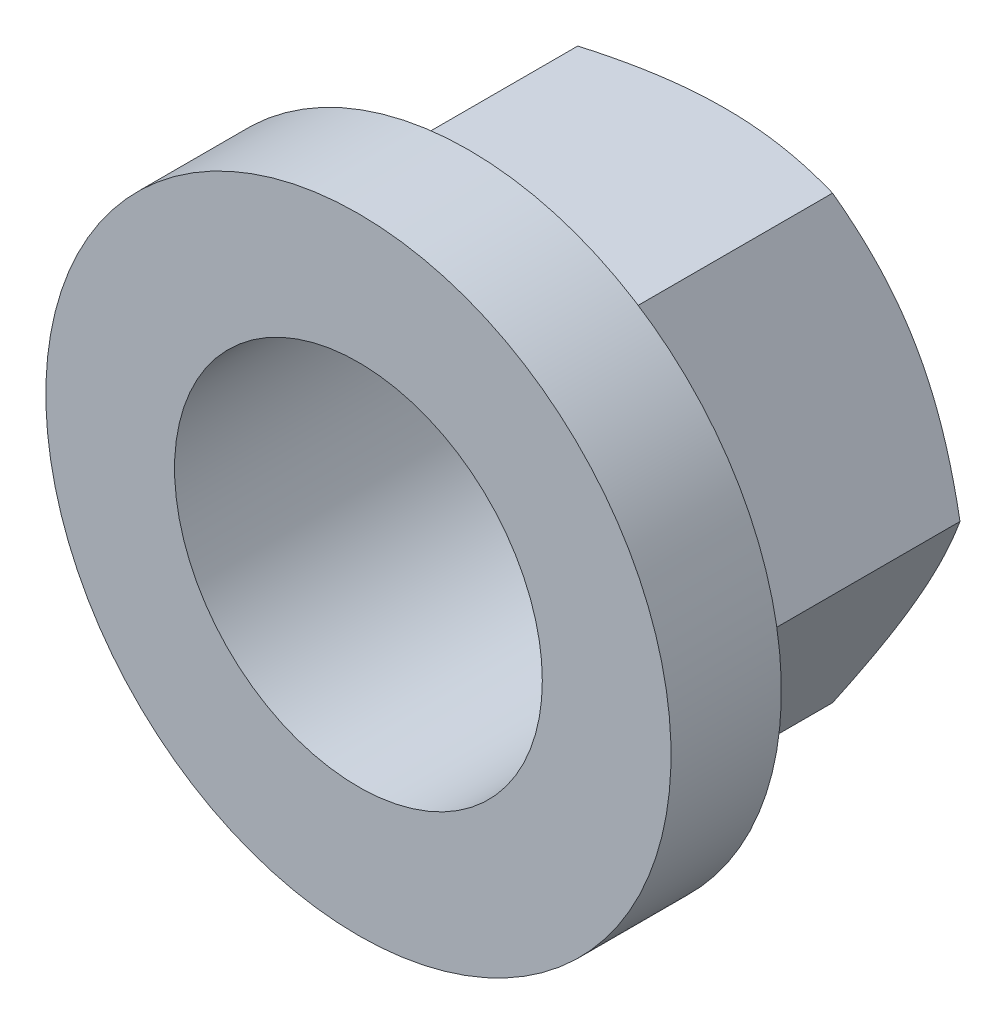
ISO-10303-21;
HEADER;
FILE_DESCRIPTION(('STEP AP214'),'2;1');
FILE_NAME('part.step','',(''),(''),'','','');
FILE_SCHEMA(('AUTOMOTIVE_DESIGN { 1 0 10303 214 1 1 1 1 }'));
ENDSEC;
DATA;
#1=APPLICATION_CONTEXT('core data for automotive mechanical design processes');
#2=APPLICATION_PROTOCOL_DEFINITION('international standard','automotive_design',2000,#1);
#3=PRODUCT_CONTEXT('',#1,'mechanical');
#4=PRODUCT('Part','Part','',(#3));
#5=PRODUCT_RELATED_PRODUCT_CATEGORY('part','',(#4));
#6=PRODUCT_DEFINITION_FORMATION('','',#4);
#7=PRODUCT_DEFINITION_CONTEXT('part definition',#1,'design');
#8=PRODUCT_DEFINITION('design','',#6,#7);
#9=PRODUCT_DEFINITION_SHAPE('','',#8);
#10=(LENGTH_UNIT() NAMED_UNIT(*) SI_UNIT(.MILLI.,.METRE.));
#11=(NAMED_UNIT(*) PLANE_ANGLE_UNIT() SI_UNIT($,.RADIAN.));
#12=(NAMED_UNIT(*) SI_UNIT($,.STERADIAN.) SOLID_ANGLE_UNIT());
#13=UNCERTAINTY_MEASURE_WITH_UNIT(LENGTH_MEASURE(1.E-05),#10,'distance_accuracy_value','');
#14=(GEOMETRIC_REPRESENTATION_CONTEXT(3) GLOBAL_UNCERTAINTY_ASSIGNED_CONTEXT((#13)) GLOBAL_UNIT_ASSIGNED_CONTEXT((#10,
#11,#12)) REPRESENTATION_CONTEXT('',''));
#15=CARTESIAN_POINT('',(0.,0.,0.));
#16=DIRECTION('',(0.,0.,1.));
#17=DIRECTION('',(1.,0.,0.));
#18=AXIS2_PLACEMENT_3D('',#15,#16,#17);
#19=CARTESIAN_POINT('',(0.,0.,3.21410161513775));
#20=DIRECTION('',(0.,0.,-1.));
#21=DIRECTION('',(0.,1.,0.));
#22=AXIS2_PLACEMENT_3D('',#19,#20,#21);
#23=PLANE('',#22);
#24=CARTESIAN_POINT('',(0.,0.,3.21410161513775));
#25=DIRECTION('',(0.,0.,-1.));
#26=DIRECTION('',(0.,1.,0.));
#27=AXIS2_PLACEMENT_3D('',#24,#25,#26);
#28=CIRCLE('',#27,8.5);
#29=CARTESIAN_POINT('',(0.,8.5,3.21410161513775));
#30=VERTEX_POINT('',#29);
#31=EDGE_CURVE('E252',#30,#30,#28,.T.);
#32=ORIENTED_EDGE('',*,*,#31,.T.);
#33=EDGE_LOOP('',(#32));
#34=FACE_BOUND('',#33,.T.);
#35=DIRECTION('',(-1.,0.,0.));
#36=VECTOR('',#35,1.);
#37=CARTESIAN_POINT('',(-3.46410161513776,-6.,3.21410161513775));
#38=LINE('',#37,#36);
#39=CARTESIAN_POINT('',(3.46410161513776,-6.,3.21410161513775));
#40=VERTEX_POINT('',#39);
#41=CARTESIAN_POINT('',(-3.46410161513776,-6.,3.21410161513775));
#42=VERTEX_POINT('',#41);
#43=EDGE_CURVE('E226',#40,#42,#38,.T.);
#44=ORIENTED_EDGE('',*,*,#43,.F.);
#45=DIRECTION('',(-0.5,-0.866025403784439,0.));
#46=VECTOR('',#45,1.);
#47=CARTESIAN_POINT('',(3.46410161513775,-6.,3.21410161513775));
#48=LINE('',#47,#46);
#49=CARTESIAN_POINT('',(6.92820323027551,0.,3.21410161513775));
#50=VERTEX_POINT('',#49);
#51=EDGE_CURVE('E263',#50,#40,#48,.T.);
#52=ORIENTED_EDGE('',*,*,#51,.F.);
#53=DIRECTION('',(0.5,-0.866025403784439,0.));
#54=VECTOR('',#53,1.);
#55=CARTESIAN_POINT('',(6.92820323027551,0.,3.21410161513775));
#56=LINE('',#55,#54);
#57=CARTESIAN_POINT('',(3.46410161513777,6.,3.21410161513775));
#58=VERTEX_POINT('',#57);
#59=EDGE_CURVE('E114',#58,#50,#56,.T.);
#60=ORIENTED_EDGE('',*,*,#59,.F.);
#61=DIRECTION('',(1.,0.,0.));
#62=VECTOR('',#61,1.);
#63=CARTESIAN_POINT('',(3.46410161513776,6.,3.21410161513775));
#64=LINE('',#63,#62);
#65=CARTESIAN_POINT('',(-3.46410161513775,6.00000000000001,3.21410161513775));
#66=VERTEX_POINT('',#65);
#67=EDGE_CURVE('E109',#66,#58,#64,.T.);
#68=ORIENTED_EDGE('',*,*,#67,.F.);
#69=DIRECTION('',(0.5,0.866025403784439,0.));
#70=VECTOR('',#69,1.);
#71=CARTESIAN_POINT('',(-3.46410161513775,6.,3.21410161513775));
#72=LINE('',#71,#70);
#73=CARTESIAN_POINT('',(-6.9282032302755,0.,3.21410161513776));
#74=VERTEX_POINT('',#73);
#75=EDGE_CURVE('E111',#74,#66,#72,.T.);
#76=ORIENTED_EDGE('',*,*,#75,.F.);
#77=DIRECTION('',(-0.499999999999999,0.866025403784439,0.));
#78=VECTOR('',#77,1.);
#79=CARTESIAN_POINT('',(-6.9282032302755,0.,3.21410161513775));
#80=LINE('',#79,#78);
#81=EDGE_CURVE('E126',#42,#74,#80,.T.);
#82=ORIENTED_EDGE('',*,*,#81,.F.);
#83=EDGE_LOOP('',(#44,#52,#60,#68,#76,#82));
#84=FACE_BOUND('',#83,.T.);
#85=ADVANCED_FACE('F34',(#34,#84),#23,.T.);
#86=CARTESIAN_POINT('',(0.,0.,0.));
#87=DIRECTION('',(0.,0.,-1.));
#88=DIRECTION('',(0.,1.,0.));
#89=AXIS2_PLACEMENT_3D('',#86,#87,#88);
#90=CYLINDRICAL_SURFACE('',#89,8.5);
#91=CARTESIAN_POINT('',(0.,0.,6.21410161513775));
#92=DIRECTION('',(0.,0.,-1.));
#93=DIRECTION('',(0.,1.,0.));
#94=AXIS2_PLACEMENT_3D('',#91,#92,#93);
#95=CIRCLE('',#94,8.5);
#96=CARTESIAN_POINT('',(0.,8.5,6.21410161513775));
#97=VERTEX_POINT('',#96);
#98=EDGE_CURVE('E254',#97,#97,#95,.T.);
#99=ORIENTED_EDGE('',*,*,#98,.T.);
#100=EDGE_LOOP('',(#99));
#101=FACE_BOUND('',#100,.T.);
#102=ORIENTED_EDGE('',*,*,#31,.F.);
#103=EDGE_LOOP('',(#102));
#104=FACE_BOUND('',#103,.T.);
#105=ADVANCED_FACE('F243',(#101,#104),#90,.T.);
#106=CARTESIAN_POINT('',(0.,0.,6.21410161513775));
#107=DIRECTION('',(0.,0.,1.));
#108=DIRECTION('',(0.,-1.,0.));
#109=AXIS2_PLACEMENT_3D('',#106,#107,#108);
#110=PLANE('',#109);
#111=CARTESIAN_POINT('',(0.,0.,6.21410161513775));
#112=DIRECTION('',(0.,0.,1.));
#113=DIRECTION('',(1.,0.,0.));
#114=AXIS2_PLACEMENT_3D('',#111,#112,#113);
#115=CIRCLE('',#114,5.);
#116=CARTESIAN_POINT('',(5.,0.,6.21410161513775));
#117=VERTEX_POINT('',#116);
#118=EDGE_CURVE('E287',#117,#117,#115,.T.);
#119=ORIENTED_EDGE('',*,*,#118,.F.);
#120=EDGE_LOOP('',(#119));
#121=FACE_BOUND('',#120,.T.);
#122=ORIENTED_EDGE('',*,*,#98,.F.);
#123=EDGE_LOOP('',(#122));
#124=FACE_BOUND('',#123,.T.);
#125=ADVANCED_FACE('F248',(#121,#124),#110,.T.);
#126=CARTESIAN_POINT('',(-3.46410161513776,-6.,3.75));
#127=DIRECTION('',(0.,1.,0.));
#128=DIRECTION('',(-1.,0.,0.));
#129=AXIS2_PLACEMENT_3D('',#126,#127,#128);
#130=PLANE('',#129);
#131=DIRECTION('',(0.,0.,-1.));
#132=VECTOR('',#131,1.);
#133=CARTESIAN_POINT('',(3.46410161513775,-6.,3.75));
#134=LINE('',#133,#132);
#135=CARTESIAN_POINT('',(3.46410161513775,-6.,-3.21410161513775));
#136=VERTEX_POINT('',#135);
#137=EDGE_CURVE('E140',#40,#136,#134,.T.);
#138=ORIENTED_EDGE('',*,*,#137,.F.);
#139=ORIENTED_EDGE('',*,*,#43,.T.);
#140=DIRECTION('',(0.,0.,-1.));
#141=VECTOR('',#140,1.);
#142=CARTESIAN_POINT('',(-3.46410161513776,-6.,3.75));
#143=LINE('',#142,#141);
#144=CARTESIAN_POINT('',(-3.46410161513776,-6.,-3.21410161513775));
#145=VERTEX_POINT('',#144);
#146=EDGE_CURVE('E136',#42,#145,#143,.T.);
#147=ORIENTED_EDGE('',*,*,#146,.T.);
#148=CARTESIAN_POINT('',(-9.37434719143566,-6.,-0.788154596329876));
#149=CARTESIAN_POINT('',(-9.11159664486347,-6.,-0.915889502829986));
#150=CARTESIAN_POINT('',(-8.84825012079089,-6.,-1.04241913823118));
#151=CARTESIAN_POINT('',(-8.32004824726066,-6.,-1.29239100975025));
#152=CARTESIAN_POINT('',(-8.05519267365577,-6.,-1.41583277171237));
#153=CARTESIAN_POINT('',(-7.52232548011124,-6.,-1.6595577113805));
#154=CARTESIAN_POINT('',(-7.25430457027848,-6.,-1.77982064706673));
#155=CARTESIAN_POINT('',(-6.71615392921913,-6.,-2.0155135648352));
#156=CARTESIAN_POINT('',(-6.44602429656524,-6.,-2.13094377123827));
#157=CARTESIAN_POINT('',(-5.89445558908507,-6.,-2.35932867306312));
#158=CARTESIAN_POINT('',(-5.61293307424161,-6.,-2.47208293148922));
#159=CARTESIAN_POINT('',(-5.04662051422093,-6.,-2.68922432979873));
#160=CARTESIAN_POINT('',(-4.7618301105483,-6.,-2.7936105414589));
#161=CARTESIAN_POINT('',(-4.18903963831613,-6.,-2.99132808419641));
#162=CARTESIAN_POINT('',(-3.90104714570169,-6.,-3.08468115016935));
#163=CARTESIAN_POINT('',(-3.32092961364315,-6.,-3.25738274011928));
#164=CARTESIAN_POINT('',(-3.02880588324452,-6.,-3.33673559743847));
#165=CARTESIAN_POINT('',(-2.44180312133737,-6.,-3.47727999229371));
#166=CARTESIAN_POINT('',(-2.14694713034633,-6.,-3.5385662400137));
#167=CARTESIAN_POINT('',(-1.55345729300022,-6.,-3.63951072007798));
#168=CARTESIAN_POINT('',(-1.25482386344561,-6.,-3.67917131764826));
#169=CARTESIAN_POINT('',(-0.807215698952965,-6.,-3.71981310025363));
#170=CARTESIAN_POINT('',(-0.659059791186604,-6.,-3.73021070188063));
#171=CARTESIAN_POINT('',(-0.362434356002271,-6.,-3.74473309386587));
#172=CARTESIAN_POINT('',(-0.213964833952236,-6.,-3.74885799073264));
#173=CARTESIAN_POINT('',(0.0830171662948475,-6.,-3.75072952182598));
#174=CARTESIAN_POINT('',(0.23152964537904,-6.,-3.74847601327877));
#175=CARTESIAN_POINT('',(0.528326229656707,-6.,-3.73764825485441));
#176=CARTESIAN_POINT('',(0.676610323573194,-6.,-3.72907370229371));
#177=CARTESIAN_POINT('',(1.0307338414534,-6.,-3.7012311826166));
#178=CARTESIAN_POINT('',(1.23635220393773,-6.,-3.67908921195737));
#179=CARTESIAN_POINT('',(1.64609980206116,-6.,-3.62384140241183));
#180=CARTESIAN_POINT('',(1.85022884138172,-6.,-3.59073414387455));
#181=CARTESIAN_POINT('',(2.46011094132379,-6.,-3.47671763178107));
#182=CARTESIAN_POINT('',(2.8631585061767,-6.,-3.38113151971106));
#183=CARTESIAN_POINT('',(3.46624827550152,-6.,-3.21482537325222));
#184=CARTESIAN_POINT('',(3.66939855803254,-6.,-3.15472502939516));
#185=CARTESIAN_POINT('',(4.07372546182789,-6.,-3.02815690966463));
#186=CARTESIAN_POINT('',(4.27490206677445,-6.,-2.96168908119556));
#187=CARTESIAN_POINT('',(4.67534909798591,-6.,-2.82346306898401));
#188=CARTESIAN_POINT('',(4.87462004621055,-6.,-2.75170638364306));
#189=CARTESIAN_POINT('',(5.27149669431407,-6.,-2.60375957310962));
#190=CARTESIAN_POINT('',(5.4691024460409,-6.,-2.5275695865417));
#191=CARTESIAN_POINT('',(6.05329419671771,-6.,-2.29601415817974));
#192=CARTESIAN_POINT('',(6.43778007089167,-6.,-2.13535342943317));
#193=CARTESIAN_POINT('',(7.20237916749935,-6.,-1.80390412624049));
#194=CARTESIAN_POINT('',(7.58249171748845,-6.00000000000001,-1.633114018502));
#195=CARTESIAN_POINT('',(8.33949830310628,-6.00000000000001,-1.28408337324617));
#196=CARTESIAN_POINT('',(8.71639063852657,-6.00000000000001,-1.10583916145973));
#197=CARTESIAN_POINT('',(9.46750615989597,-6.00000000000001,-0.743889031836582));
#198=CARTESIAN_POINT('',(9.84172949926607,-6.00000000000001,-0.560183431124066));
#199=CARTESIAN_POINT('',(10.5888150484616,-6.00000000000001,-0.188264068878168));
#200=CARTESIAN_POINT('',(10.9616733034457,-6.00000000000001,-4.23807468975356E-05));
#201=CARTESIAN_POINT('',(11.7057456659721,-6.00000000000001,0.379628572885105));
#202=CARTESIAN_POINT('',(12.0769597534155,-6.00000000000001,0.571077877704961));
#203=CARTESIAN_POINT('',(12.8179592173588,-6.00000000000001,0.956459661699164));
#204=CARTESIAN_POINT('',(13.1877449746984,-6.00000000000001,1.15039140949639));
#205=CARTESIAN_POINT('',(13.9262438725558,-6.00000000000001,1.54028763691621));
#206=CARTESIAN_POINT('',(14.2949570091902,-6.00000000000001,1.73625212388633));
#207=CARTESIAN_POINT('',(15.3097665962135,-6.00000000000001,2.2785046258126));
#208=CARTESIAN_POINT('',(15.9549512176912,-6.00000000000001,2.62649859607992));
#209=CARTESIAN_POINT('',(17.2434201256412,-6.00000000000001,3.32610499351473));
#210=CARTESIAN_POINT('',(17.8867042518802,-6.00000000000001,3.67771771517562));
#211=CARTESIAN_POINT('',(19.1694209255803,-6.00000000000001,4.38227161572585));
#212=CARTESIAN_POINT('',(19.8088588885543,-6.00000000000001,4.73520294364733));
#213=CARTESIAN_POINT('',(21.0865502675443,-6.00000000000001,5.44305970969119));
#214=CARTESIAN_POINT('',(21.7248037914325,-6.00000000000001,5.79798495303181));
#215=CARTESIAN_POINT('',(22.3626558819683,-6.00000000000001,6.15362541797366));
#216=B_SPLINE_CURVE_WITH_KNOTS('',3,(#148,#149,#150,#151,#152,#153,#154,#155,#156,#157,#158,
#159,#160,#161,#162,#163,#164,#165,#166,#167,#168,#169,#170,#171,#172,#173,#174,#175,#176,#177,
#178,#179,#180,#181,#182,#183,#184,#185,#186,#187,#188,#189,#190,#191,#192,#193,#194,#195,#196,
#197,#198,#199,#200,#201,#202,#203,#204,#205,#206,#207,#208,#209,#210,#211,#212,#213,#214,#215),
.UNSPECIFIED.,.F.,.F.,(4,2,2,2,2,2,2,2,2,2,2,2,2,2,2,2,2,2,2,2,2,2,2,2,2,2,2,2,2,2,2,2,2,4),(0.,
0.876472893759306,1.75307955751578,2.63433891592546,3.51555732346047,4.42524359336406,
5.33503063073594,6.24299444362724,7.15067672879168,8.05351243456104,8.95624937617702,
9.4016977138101,9.84713848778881,10.292589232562,10.7380613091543,11.3581343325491,
11.9782876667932,13.2191954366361,13.8547020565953,14.4902139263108,15.1255464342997,
15.7608590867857,17.0107329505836,18.260796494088,19.5114836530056,20.7620983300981,
22.0150971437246,23.2681112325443,24.5207642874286,25.7734218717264,27.9725551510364,
30.1718688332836,32.3629769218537,34.5538745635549),.UNSPECIFIED.);
#217=CARTESIAN_POINT('',(0.,-6.,-3.75));
#218=VERTEX_POINT('',#217);
#219=EDGE_CURVE('E211',#218,#145,#216,.F.);
#220=ORIENTED_EDGE('',*,*,#219,.F.);
#221=EDGE_CURVE('E216',#136,#218,#216,.F.);
#222=ORIENTED_EDGE('',*,*,#221,.F.);
#223=EDGE_LOOP('',(#138,#139,#147,#220,#222));
#224=FACE_BOUND('',#223,.T.);
#225=ADVANCED_FACE('F36',(#224),#130,.F.);
#226=CARTESIAN_POINT('',(3.46410161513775,-6.,3.75));
#227=DIRECTION('',(-0.866025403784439,0.5,0.));
#228=DIRECTION('',(-0.5,-0.866025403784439,0.));
#229=AXIS2_PLACEMENT_3D('',#226,#227,#228);
#230=PLANE('',#229);
#231=DIRECTION('',(0.,0.,-1.));
#232=VECTOR('',#231,1.);
#233=CARTESIAN_POINT('',(6.92820323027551,0.,3.75));
#234=LINE('',#233,#232);
#235=CARTESIAN_POINT('',(6.92820323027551,0.,-3.21410161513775));
#236=VERTEX_POINT('',#235);
#237=EDGE_CURVE('E134',#50,#236,#234,.T.);
#238=ORIENTED_EDGE('',*,*,#237,.F.);
#239=ORIENTED_EDGE('',*,*,#51,.T.);
#240=ORIENTED_EDGE('',*,*,#137,.T.);
#241=CARTESIAN_POINT('',(6.92831870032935,0.0002,-3.21403494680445));
#242=CARTESIAN_POINT('',(6.85217369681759,-0.131687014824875,-3.25799100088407));
#243=CARTESIAN_POINT('',(6.7757447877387,-0.264065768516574,-3.2999521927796));
#244=CARTESIAN_POINT('',(6.62226628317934,-0.52989833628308,-3.37933542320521));
#245=CARTESIAN_POINT('',(6.54521643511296,-0.663352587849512,-3.41675550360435));
#246=CARTESIAN_POINT('',(6.31283321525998,-1.06585213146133,-3.52146958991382));
#247=CARTESIAN_POINT('',(6.15658254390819,-1.33648623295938,-3.58102994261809));
#248=CARTESIAN_POINT('',(5.92275625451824,-1.74148524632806,-3.65087178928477));
#249=CARTESIAN_POINT('',(5.84587929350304,-1.87464004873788,-3.67076777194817));
#250=CARTESIAN_POINT('',(5.69177799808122,-2.14155132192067,-3.70413058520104));
#251=CARTESIAN_POINT('',(5.6145536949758,-2.27530773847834,-3.71759798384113));
#252=CARTESIAN_POINT('',(5.45997096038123,-2.54305288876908,-3.73776040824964));
#253=CARTESIAN_POINT('',(5.38261278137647,-2.67704118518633,-3.74446312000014));
#254=CARTESIAN_POINT('',(5.22782922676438,-2.94513416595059,-3.75095963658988));
#255=CARTESIAN_POINT('',(5.1504038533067,-3.07923884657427,-3.75075365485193));
#256=CARTESIAN_POINT('',(4.93828180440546,-3.44664501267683,-3.74069281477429));
#257=CARTESIAN_POINT('',(4.80365456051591,-3.6798262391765,-3.72380210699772));
#258=CARTESIAN_POINT('',(4.53529425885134,-4.14463991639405,-3.67024077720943));
#259=CARTESIAN_POINT('',(4.40156214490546,-4.37627073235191,-3.63355184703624));
#260=CARTESIAN_POINT('',(4.13266173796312,-4.84201989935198,-3.5418398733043));
#261=CARTESIAN_POINT('',(3.99752737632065,-5.07607947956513,-3.48642824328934));
#262=CARTESIAN_POINT('',(3.7292739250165,-5.54070808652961,-3.36066608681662));
#263=CARTESIAN_POINT('',(3.59615139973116,-5.77128306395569,-3.29034510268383));
#264=CARTESIAN_POINT('',(3.46398614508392,-6.0002,-3.21403494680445));
#265=B_SPLINE_CURVE_WITH_KNOTS('',3,(#241,#242,#243,#244,#245,#246,#247,#248,#249,#250,#251,
#252,#253,#254,#255,#256,#257,#258,#259,#260,#261,#262,#263,#264),.UNSPECIFIED.,.F.,.F.,(4,2,2,
2,2,2,2,2,2,2,2,4),(0.,0.475482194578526,0.951168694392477,1.90451835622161,2.36951738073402,
2.83447530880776,3.29890435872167,3.76331906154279,4.57182194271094,5.38107376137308,
6.20827406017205,7.03385036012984),.UNSPECIFIED.);
#266=CARTESIAN_POINT('',(5.19615242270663,-3.,-3.75));
#267=VERTEX_POINT('',#266);
#268=EDGE_CURVE('E157',#267,#136,#265,.T.);
#269=ORIENTED_EDGE('',*,*,#268,.F.);
#270=EDGE_CURVE('E160',#236,#267,#265,.T.);
#271=ORIENTED_EDGE('',*,*,#270,.F.);
#272=EDGE_LOOP('',(#238,#239,#240,#269,#271));
#273=FACE_BOUND('',#272,.T.);
#274=ADVANCED_FACE('F159',(#273),#230,.F.);
#275=CARTESIAN_POINT('',(6.92820323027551,0.,3.75));
#276=DIRECTION('',(-0.866025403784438,-0.5,0.));
#277=DIRECTION('',(0.5,-0.866025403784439,0.));
#278=AXIS2_PLACEMENT_3D('',#275,#276,#277);
#279=PLANE('',#278);
#280=DIRECTION('',(0.,0.,-1.));
#281=VECTOR('',#280,1.);
#282=CARTESIAN_POINT('',(3.46410161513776,6.,3.75));
#283=LINE('',#282,#281);
#284=CARTESIAN_POINT('',(3.46410161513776,6.,-3.21410161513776));
#285=VERTEX_POINT('',#284);
#286=EDGE_CURVE('E132',#58,#285,#283,.T.);
#287=ORIENTED_EDGE('',*,*,#286,.F.);
#288=ORIENTED_EDGE('',*,*,#59,.T.);
#289=ORIENTED_EDGE('',*,*,#237,.T.);
#290=CARTESIAN_POINT('',(3.46398614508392,6.0002,-3.21403494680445));
#291=CARTESIAN_POINT('',(3.54013114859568,5.86831298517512,-3.25799100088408));
#292=CARTESIAN_POINT('',(3.61656005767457,5.73593423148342,-3.2999521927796));
#293=CARTESIAN_POINT('',(3.77003856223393,5.47010166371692,-3.37933542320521));
#294=CARTESIAN_POINT('',(3.84708841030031,5.33664741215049,-3.41675550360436));
#295=CARTESIAN_POINT('',(4.07947163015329,4.93414786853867,-3.52146958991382));
#296=CARTESIAN_POINT('',(4.23572230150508,4.66351376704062,-3.5810299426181));
#297=CARTESIAN_POINT('',(4.46954859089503,4.25851475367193,-3.65087178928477));
#298=CARTESIAN_POINT('',(4.54642555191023,4.12535995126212,-3.67076777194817));
#299=CARTESIAN_POINT('',(4.70052684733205,3.85844867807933,-3.70413058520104));
#300=CARTESIAN_POINT('',(4.77775115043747,3.72469226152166,-3.71759798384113));
#301=CARTESIAN_POINT('',(4.93233388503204,3.45694711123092,-3.73776040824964));
#302=CARTESIAN_POINT('',(5.0096920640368,3.32295881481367,-3.74446312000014));
#303=CARTESIAN_POINT('',(5.16447561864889,3.05486583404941,-3.75095963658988));
#304=CARTESIAN_POINT('',(5.24190099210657,2.92076115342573,-3.75075365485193));
#305=CARTESIAN_POINT('',(5.45402304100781,2.55335498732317,-3.74069281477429));
#306=CARTESIAN_POINT('',(5.58865028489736,2.32017376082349,-3.72380210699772));
#307=CARTESIAN_POINT('',(5.85701058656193,1.85536008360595,-3.67024077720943));
#308=CARTESIAN_POINT('',(5.99074270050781,1.6237292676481,-3.63355184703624));
#309=CARTESIAN_POINT('',(6.25964310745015,1.15798010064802,-3.5418398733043));
#310=CARTESIAN_POINT('',(6.39477746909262,0.923920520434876,-3.48642824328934));
#311=CARTESIAN_POINT('',(6.66303092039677,0.45929191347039,-3.36066608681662));
#312=CARTESIAN_POINT('',(6.7961534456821,0.22871693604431,-3.29034510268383));
#313=CARTESIAN_POINT('',(6.92831870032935,-0.000199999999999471,-3.21403494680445));
#314=B_SPLINE_CURVE_WITH_KNOTS('',3,(#290,#291,#292,#293,#294,#295,#296,#297,#298,#299,#300,
#301,#302,#303,#304,#305,#306,#307,#308,#309,#310,#311,#312,#313),.UNSPECIFIED.,.F.,.F.,(4,2,2,
2,2,2,2,2,2,2,2,4),(0.,0.475482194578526,0.951168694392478,1.90451835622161,2.36951738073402,
2.83447530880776,3.29890435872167,3.76331906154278,4.57182194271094,5.38107376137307,
6.20827406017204,7.03385036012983),.UNSPECIFIED.);
#315=CARTESIAN_POINT('',(5.19615242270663,3.,-3.75));
#316=VERTEX_POINT('',#315);
#317=EDGE_CURVE('E177',#316,#236,#314,.T.);
#318=ORIENTED_EDGE('',*,*,#317,.F.);
#319=EDGE_CURVE('E225',#285,#316,#314,.T.);
#320=ORIENTED_EDGE('',*,*,#319,.F.);
#321=EDGE_LOOP('',(#287,#288,#289,#318,#320));
#322=FACE_BOUND('',#321,.T.);
#323=ADVANCED_FACE('F266',(#322),#279,.F.);
#324=CARTESIAN_POINT('',(3.46410161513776,6.,3.75));
#325=DIRECTION('',(0.,-1.,0.));
#326=DIRECTION('',(1.,0.,0.));
#327=AXIS2_PLACEMENT_3D('',#324,#325,#326);
#328=PLANE('',#327);
#329=DIRECTION('',(0.,0.,-1.));
#330=VECTOR('',#329,1.);
#331=CARTESIAN_POINT('',(-3.46410161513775,6.,3.75));
#332=LINE('',#331,#330);
#333=CARTESIAN_POINT('',(-3.46410161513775,6.,-3.21410161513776));
#334=VERTEX_POINT('',#333);
#335=EDGE_CURVE('E123',#66,#334,#332,.T.);
#336=ORIENTED_EDGE('',*,*,#335,.F.);
#337=ORIENTED_EDGE('',*,*,#67,.T.);
#338=ORIENTED_EDGE('',*,*,#286,.T.);
#339=CARTESIAN_POINT('',(-9.37434719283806,6.,-0.788154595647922));
#340=CARTESIAN_POINT('',(-9.11159664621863,6.,-0.915889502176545));
#341=CARTESIAN_POINT('',(-8.84825012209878,6.,-1.04241913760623));
#342=CARTESIAN_POINT('',(-8.32004824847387,6.,-1.29239100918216));
#343=CARTESIAN_POINT('',(-8.05519267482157,6.,-1.41583277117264));
#344=CARTESIAN_POINT('',(-7.52232548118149,6.,-1.65955771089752));
#345=CARTESIAN_POINT('',(-7.25430457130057,6.,-1.77982064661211));
#346=CARTESIAN_POINT('',(-6.71615393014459,6.,-2.01551356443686));
#347=CARTESIAN_POINT('',(-6.44602429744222,6.,-2.13094377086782));
#348=CARTESIAN_POINT('',(-5.89445558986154,6.,-2.35932867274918));
#349=CARTESIAN_POINT('',(-5.61293307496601,6.,-2.47208293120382));
#350=CARTESIAN_POINT('',(-5.04662051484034,6.,-2.68922432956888));
#351=CARTESIAN_POINT('',(-4.7618301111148,6.,-2.79361054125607));
#352=CARTESIAN_POINT('',(-4.18903963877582,6.,-2.991328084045));
#353=CARTESIAN_POINT('',(-3.90104714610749,6.,-3.08468115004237));
#354=CARTESIAN_POINT('',(-3.32092961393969,6.,-3.25738274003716));
#355=CARTESIAN_POINT('',(-3.02880588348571,6.,-3.33673559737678));
#356=CARTESIAN_POINT('',(-2.44180312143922,6.,-3.47727999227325));
#357=CARTESIAN_POINT('',(-2.14694713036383,6.,-3.53856624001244));
#358=CARTESIAN_POINT('',(-1.55345729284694,6.,-3.63951072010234));
#359=CARTESIAN_POINT('',(-1.25482386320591,6.,-3.67917131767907));
#360=CARTESIAN_POINT('',(-0.807215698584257,6.,-3.71981310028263));
#361=CARTESIAN_POINT('',(-0.659059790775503,6.,-3.73021070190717));
#362=CARTESIAN_POINT('',(-0.362434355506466,6.,-3.74473309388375));
#363=CARTESIAN_POINT('',(-0.213964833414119,6.,-3.74885799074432));
#364=CARTESIAN_POINT('',(0.0830171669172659,6.,-3.75072952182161));
#365=CARTESIAN_POINT('',(0.231529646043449,6.,-3.74847601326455));
#366=CARTESIAN_POINT('',(0.52832623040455,6.,-3.7376482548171));
#367=CARTESIAN_POINT('',(0.67661032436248,6.,-3.72907370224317));
#368=CARTESIAN_POINT('',(1.03073384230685,6.,-3.7012311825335));
#369=CARTESIAN_POINT('',(1.23635220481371,6.,-3.67908921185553));
#370=CARTESIAN_POINT('',(1.64609980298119,6.,-3.62384140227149));
#371=CARTESIAN_POINT('',(1.85022884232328,6.,-3.59073414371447));
#372=CARTESIAN_POINT('',(2.46011094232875,6.,-3.47671763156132));
#373=CARTESIAN_POINT('',(2.86315850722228,6.,-3.381131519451));
#374=CARTESIAN_POINT('',(3.46624827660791,6.,-3.21482537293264));
#375=CARTESIAN_POINT('',(3.66939855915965,6.,-3.15472502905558));
#376=CARTESIAN_POINT('',(4.07372546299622,6.,-3.02815690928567));
#377=CARTESIAN_POINT('',(4.27490206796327,6.,-2.96168908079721));
#378=CARTESIAN_POINT('',(4.67534909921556,6.,-2.82346306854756));
#379=CARTESIAN_POINT('',(4.87462004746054,6.,-2.75170638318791));
#380=CARTESIAN_POINT('',(5.27149669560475,6.,-2.60375957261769));
#381=CARTESIAN_POINT('',(5.46910244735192,6.,-2.52756958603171));
#382=CARTESIAN_POINT('',(6.05329419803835,6.,-2.29601415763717));
#383=CARTESIAN_POINT('',(6.43778007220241,6.,-2.13535342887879));
#384=CARTESIAN_POINT('',(7.20237916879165,6.,-1.80390412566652));
#385=CARTESIAN_POINT('',(7.5824917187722,6.,-1.63311401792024));
#386=CARTESIAN_POINT('',(8.33949830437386,6.,-1.2840833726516));
#387=CARTESIAN_POINT('',(8.71639063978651,6.,-1.10583916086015));
#388=CARTESIAN_POINT('',(9.46750616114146,6.,-0.743889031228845));
#389=CARTESIAN_POINT('',(9.84172950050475,5.99999999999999,-0.560183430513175));
#390=CARTESIAN_POINT('',(10.5888150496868,5.99999999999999,-0.18826406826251));
#391=CARTESIAN_POINT('',(10.9616733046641,5.99999999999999,-4.23801296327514E-05));
#392=CARTESIAN_POINT('',(11.7057456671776,5.99999999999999,0.379628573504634));
#393=CARTESIAN_POINT('',(12.0769597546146,5.99999999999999,0.571077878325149));
#394=CARTESIAN_POINT('',(12.8179592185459,5.99999999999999,0.956459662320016));
#395=CARTESIAN_POINT('',(13.1877449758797,5.99999999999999,1.15039141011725));
#396=CARTESIAN_POINT('',(13.9262438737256,5.99999999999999,1.54028763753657));
#397=CARTESIAN_POINT('',(14.2949570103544,5.99999999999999,1.73625212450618));
#398=CARTESIAN_POINT('',(15.3097665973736,5.99999999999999,2.27850462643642));
#399=CARTESIAN_POINT('',(15.954951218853,5.99999999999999,2.6264985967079));
#400=CARTESIAN_POINT('',(17.2434201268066,5.99999999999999,3.32610499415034));
#401=CARTESIAN_POINT('',(17.8867042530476,5.99999999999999,3.67771771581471));
#402=CARTESIAN_POINT('',(19.1694209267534,5.99999999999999,4.3822716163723));
#403=CARTESIAN_POINT('',(19.8088588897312,5.99999999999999,4.73520294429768));
#404=CARTESIAN_POINT('',(21.0865502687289,5.99999999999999,5.44305971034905));
#405=CARTESIAN_POINT('',(21.724803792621,5.99999999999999,5.79798495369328));
#406=CARTESIAN_POINT('',(22.3626558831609,5.99999999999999,6.15362541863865));
#407=B_SPLINE_CURVE_WITH_KNOTS('',3,(#339,#340,#341,#342,#343,#344,#345,#346,#347,#348,#349,
#350,#351,#352,#353,#354,#355,#356,#357,#358,#359,#360,#361,#362,#363,#364,#365,#366,#367,#368,
#369,#370,#371,#372,#373,#374,#375,#376,#377,#378,#379,#380,#381,#382,#383,#384,#385,#386,#387,
#388,#389,#390,#391,#392,#393,#394,#395,#396,#397,#398,#399,#400,#401,#402,#403,#404,#405,#406),
.UNSPECIFIED.,.F.,.F.,(4,2,2,2,2,2,2,2,2,2,2,2,2,2,2,2,2,2,2,2,2,2,2,2,2,2,2,2,2,2,2,2,2,4),(0.,
0.876472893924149,1.75307955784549,2.6343389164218,3.51555732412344,4.42524359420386,
5.33503063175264,6.24299444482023,7.15067673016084,8.05351243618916,8.95624937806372,
9.40169771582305,9.847138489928,10.2925892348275,10.7380613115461,11.3581343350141,
11.9782876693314,13.219195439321,13.8547020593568,14.490213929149,15.1255464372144,
15.7608590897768,17.0107329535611,18.2607964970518,19.5114836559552,20.7620983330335,
22.0150971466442,23.2681112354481,24.5207642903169,25.7734218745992,27.9725551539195,
30.1718688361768,32.3629769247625,34.5538745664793),.UNSPECIFIED.);
#408=CARTESIAN_POINT('',(0.,6.,-3.75));
#409=VERTEX_POINT('',#408);
#410=EDGE_CURVE('E164',#409,#285,#407,.T.);
#411=ORIENTED_EDGE('',*,*,#410,.F.);
#412=EDGE_CURVE('E131',#334,#409,#407,.T.);
#413=ORIENTED_EDGE('',*,*,#412,.F.);
#414=EDGE_LOOP('',(#336,#337,#338,#411,#413));
#415=FACE_BOUND('',#414,.T.);
#416=ADVANCED_FACE('F129',(#415),#328,.F.);
#417=CARTESIAN_POINT('',(-3.46410161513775,6.,3.75));
#418=DIRECTION('',(0.866025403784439,-0.5,0.));
#419=DIRECTION('',(0.5,0.866025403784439,0.));
#420=AXIS2_PLACEMENT_3D('',#417,#418,#419);
#421=PLANE('',#420);
#422=DIRECTION('',(0.,0.,-1.));
#423=VECTOR('',#422,1.);
#424=CARTESIAN_POINT('',(-6.9282032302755,0.,3.75));
#425=LINE('',#424,#423);
#426=CARTESIAN_POINT('',(-6.9282032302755,0.,-3.21410161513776));
#427=VERTEX_POINT('',#426);
#428=EDGE_CURVE('E125',#74,#427,#425,.T.);
#429=ORIENTED_EDGE('',*,*,#428,.F.);
#430=ORIENTED_EDGE('',*,*,#75,.T.);
#431=ORIENTED_EDGE('',*,*,#335,.T.);
#432=CARTESIAN_POINT('',(-6.92831870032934,-0.000199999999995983,-3.21403494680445));
#433=CARTESIAN_POINT('',(-6.85217369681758,0.131687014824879,-3.25799100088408));
#434=CARTESIAN_POINT('',(-6.77574478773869,0.264065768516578,-3.29995219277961));
#435=CARTESIAN_POINT('',(-6.62226628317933,0.529898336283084,-3.37933542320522));
#436=CARTESIAN_POINT('',(-6.54521643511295,0.663352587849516,-3.41675550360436));
#437=CARTESIAN_POINT('',(-6.31283321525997,1.06585213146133,-3.52146958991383));
#438=CARTESIAN_POINT('',(-6.15658254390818,1.33648623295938,-3.5810299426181));
#439=CARTESIAN_POINT('',(-5.92275625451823,1.74148524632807,-3.65087178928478));
#440=CARTESIAN_POINT('',(-5.84587929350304,1.87464004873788,-3.67076777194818));
#441=CARTESIAN_POINT('',(-5.69177799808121,2.14155132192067,-3.70413058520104));
#442=CARTESIAN_POINT('',(-5.61455369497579,2.27530773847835,-3.71759798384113));
#443=CARTESIAN_POINT('',(-5.45997096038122,2.54305288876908,-3.73776040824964));
#444=CARTESIAN_POINT('',(-5.38261278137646,2.67704118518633,-3.74446312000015));
#445=CARTESIAN_POINT('',(-5.22782922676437,2.94513416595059,-3.75095963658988));
#446=CARTESIAN_POINT('',(-5.1504038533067,3.07923884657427,-3.75075365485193));
#447=CARTESIAN_POINT('',(-4.93828180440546,3.44664501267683,-3.74069281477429));
#448=CARTESIAN_POINT('',(-4.8036545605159,3.6798262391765,-3.72380210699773));
#449=CARTESIAN_POINT('',(-4.53529425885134,4.14463991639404,-3.67024077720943));
#450=CARTESIAN_POINT('',(-4.40156214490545,4.3762707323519,-3.63355184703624));
#451=CARTESIAN_POINT('',(-4.13266173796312,4.84201989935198,-3.5418398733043));
#452=CARTESIAN_POINT('',(-3.99752737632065,5.07607947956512,-3.48642824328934));
#453=CARTESIAN_POINT('',(-3.7292739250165,5.54070808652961,-3.36066608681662));
#454=CARTESIAN_POINT('',(-3.59615139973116,5.77128306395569,-3.29034510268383));
#455=CARTESIAN_POINT('',(-3.46398614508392,6.0002,-3.21403494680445));
#456=B_SPLINE_CURVE_WITH_KNOTS('',3,(#432,#433,#434,#435,#436,#437,#438,#439,#440,#441,#442,
#443,#444,#445,#446,#447,#448,#449,#450,#451,#452,#453,#454,#455),.UNSPECIFIED.,.F.,.F.,(4,2,2,
2,2,2,2,2,2,2,2,4),(0.,0.475482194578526,0.951168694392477,1.90451835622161,2.36951738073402,
2.83447530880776,3.29890435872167,3.76331906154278,4.57182194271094,5.38107376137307,
6.20827406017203,7.03385036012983),.UNSPECIFIED.);
#457=CARTESIAN_POINT('',(-5.19615242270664,3.,-3.75));
#458=VERTEX_POINT('',#457);
#459=EDGE_CURVE('E165',#458,#334,#456,.T.);
#460=ORIENTED_EDGE('',*,*,#459,.F.);
#461=EDGE_CURVE('E205',#427,#458,#456,.T.);
#462=ORIENTED_EDGE('',*,*,#461,.F.);
#463=EDGE_LOOP('',(#429,#430,#431,#460,#462));
#464=FACE_BOUND('',#463,.T.);
#465=ADVANCED_FACE('F121',(#464),#421,.F.);
#466=CARTESIAN_POINT('',(-6.9282032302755,0.,3.75));
#467=DIRECTION('',(0.866025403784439,0.499999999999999,0.));
#468=DIRECTION('',(-0.499999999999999,0.866025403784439,0.));
#469=AXIS2_PLACEMENT_3D('',#466,#467,#468);
#470=PLANE('',#469);
#471=ORIENTED_EDGE('',*,*,#146,.F.);
#472=ORIENTED_EDGE('',*,*,#81,.T.);
#473=ORIENTED_EDGE('',*,*,#428,.T.);
#474=CARTESIAN_POINT('',(-3.46398614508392,-6.0002,-3.21403494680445));
#475=CARTESIAN_POINT('',(-3.54013114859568,-5.86831298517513,-3.25799100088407));
#476=CARTESIAN_POINT('',(-3.61656005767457,-5.73593423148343,-3.2999521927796));
#477=CARTESIAN_POINT('',(-3.77003856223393,-5.47010166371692,-3.37933542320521));
#478=CARTESIAN_POINT('',(-3.84708841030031,-5.33664741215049,-3.41675550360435));
#479=CARTESIAN_POINT('',(-4.07947163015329,-4.93414786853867,-3.52146958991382));
#480=CARTESIAN_POINT('',(-4.23572230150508,-4.66351376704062,-3.5810299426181));
#481=CARTESIAN_POINT('',(-4.46954859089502,-4.25851475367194,-3.65087178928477));
#482=CARTESIAN_POINT('',(-4.54642555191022,-4.12535995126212,-3.67076777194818));
#483=CARTESIAN_POINT('',(-4.70052684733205,-3.85844867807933,-3.70413058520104));
#484=CARTESIAN_POINT('',(-4.77775115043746,-3.72469226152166,-3.71759798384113));
#485=CARTESIAN_POINT('',(-4.93233388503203,-3.45694711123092,-3.73776040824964));
#486=CARTESIAN_POINT('',(-5.0096920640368,-3.32295881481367,-3.74446312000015));
#487=CARTESIAN_POINT('',(-5.16447561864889,-3.05486583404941,-3.75095963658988));
#488=CARTESIAN_POINT('',(-5.24190099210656,-2.92076115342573,-3.75075365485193));
#489=CARTESIAN_POINT('',(-5.4540230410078,-2.55335498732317,-3.74069281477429));
#490=CARTESIAN_POINT('',(-5.58865028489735,-2.32017376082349,-3.72380210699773));
#491=CARTESIAN_POINT('',(-5.85701058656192,-1.85536008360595,-3.67024077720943));
#492=CARTESIAN_POINT('',(-5.9907427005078,-1.62372926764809,-3.63355184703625));
#493=CARTESIAN_POINT('',(-6.25964310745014,-1.15798010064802,-3.5418398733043));
#494=CARTESIAN_POINT('',(-6.39477746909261,-0.923920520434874,-3.48642824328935));
#495=CARTESIAN_POINT('',(-6.66303092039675,-0.459291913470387,-3.36066608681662));
#496=CARTESIAN_POINT('',(-6.79615344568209,-0.228716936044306,-3.29034510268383));
#497=CARTESIAN_POINT('',(-6.92831870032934,0.000200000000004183,-3.21403494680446));
#498=B_SPLINE_CURVE_WITH_KNOTS('',3,(#474,#475,#476,#477,#478,#479,#480,#481,#482,#483,#484,
#485,#486,#487,#488,#489,#490,#491,#492,#493,#494,#495,#496,#497),.UNSPECIFIED.,.F.,.F.,(4,2,2,
2,2,2,2,2,2,2,2,4),(0.,0.475482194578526,0.951168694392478,1.90451835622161,2.36951738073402,
2.83447530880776,3.29890435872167,3.76331906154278,4.57182194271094,5.38107376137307,
6.20827406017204,7.03385036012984),.UNSPECIFIED.);
#499=CARTESIAN_POINT('',(-5.19615242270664,-2.99999999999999,-3.75));
#500=VERTEX_POINT('',#499);
#501=EDGE_CURVE('E197',#500,#427,#498,.T.);
#502=ORIENTED_EDGE('',*,*,#501,.F.);
#503=EDGE_CURVE('E220',#145,#500,#498,.T.);
#504=ORIENTED_EDGE('',*,*,#503,.F.);
#505=EDGE_LOOP('',(#471,#472,#473,#502,#504));
#506=FACE_BOUND('',#505,.T.);
#507=ADVANCED_FACE('F231',(#506),#470,.F.);
#508=CARTESIAN_POINT('',(-3.46410161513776,-6.,-3.75));
#509=DIRECTION('',(0.,0.,-1.));
#510=DIRECTION('',(-1.,0.,0.));
#511=AXIS2_PLACEMENT_3D('',#508,#509,#510);
#512=PLANE('',#511);
#513=CARTESIAN_POINT('',(0.,0.,-3.75));
#514=DIRECTION('',(0.,0.,1.));
#515=DIRECTION('',(1.,0.,0.));
#516=AXIS2_PLACEMENT_3D('',#513,#514,#515);
#517=CIRCLE('',#516,5.);
#518=CARTESIAN_POINT('',(5.,0.,-3.75));
#519=VERTEX_POINT('',#518);
#520=EDGE_CURVE('E258',#519,#519,#517,.T.);
#521=ORIENTED_EDGE('',*,*,#520,.T.);
#522=EDGE_LOOP('',(#521));
#523=FACE_BOUND('',#522,.T.);
#524=CARTESIAN_POINT('',(0.,0.,-3.75));
#525=DIRECTION('',(0.,0.,-1.));
#526=DIRECTION('',(-1.,0.,0.));
#527=AXIS2_PLACEMENT_3D('',#524,#525,#526);
#528=CIRCLE('',#527,6.);
#529=EDGE_CURVE('E39',#500,#458,#528,.T.);
#530=ORIENTED_EDGE('',*,*,#529,.T.);
#531=CARTESIAN_POINT('',(0.,0.,-3.75));
#532=DIRECTION('',(0.,0.,-1.));
#533=DIRECTION('',(-1.,0.,0.));
#534=AXIS2_PLACEMENT_3D('',#531,#532,#533);
#535=CIRCLE('',#534,6.);
#536=EDGE_CURVE('E51',#458,#409,#535,.T.);
#537=ORIENTED_EDGE('',*,*,#536,.T.);
#538=EDGE_CURVE('E11',#409,#316,#528,.T.);
#539=ORIENTED_EDGE('',*,*,#538,.T.);
#540=EDGE_CURVE('E44',#316,#267,#528,.T.);
#541=ORIENTED_EDGE('',*,*,#540,.T.);
#542=EDGE_CURVE('E146',#267,#218,#528,.T.);
#543=ORIENTED_EDGE('',*,*,#542,.T.);
#544=EDGE_CURVE('E59',#218,#500,#528,.T.);
#545=ORIENTED_EDGE('',*,*,#544,.T.);
#546=EDGE_LOOP('',(#530,#537,#539,#541,#543,#545));
#547=FACE_BOUND('',#546,.T.);
#548=ADVANCED_FACE('F151',(#523,#547),#512,.T.);
#549=CARTESIAN_POINT('',(0.,0.,-3.75));
#550=DIRECTION('',(0.,0.,1.));
#551=DIRECTION('',(1.,0.,0.));
#552=AXIS2_PLACEMENT_3D('',#549,#550,#551);
#553=CONICAL_SURFACE('',#552,6.,1.0471975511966);
#554=ORIENTED_EDGE('',*,*,#461,.T.);
#555=ORIENTED_EDGE('',*,*,#529,.F.);
#556=ORIENTED_EDGE('',*,*,#501,.T.);
#557=EDGE_LOOP('',(#554,#555,#556));
#558=FACE_BOUND('',#557,.T.);
#559=ADVANCED_FACE('F191',(#558),#553,.T.);
#560=ORIENTED_EDGE('',*,*,#219,.T.);
#561=ORIENTED_EDGE('',*,*,#503,.T.);
#562=ORIENTED_EDGE('',*,*,#544,.F.);
#563=EDGE_LOOP('',(#560,#561,#562));
#564=FACE_BOUND('',#563,.T.);
#565=ADVANCED_FACE('F233',(#564),#553,.T.);
#566=ORIENTED_EDGE('',*,*,#268,.T.);
#567=ORIENTED_EDGE('',*,*,#221,.T.);
#568=ORIENTED_EDGE('',*,*,#542,.F.);
#569=EDGE_LOOP('',(#566,#567,#568));
#570=FACE_BOUND('',#569,.T.);
#571=ADVANCED_FACE('F235',(#570),#553,.T.);
#572=ORIENTED_EDGE('',*,*,#317,.T.);
#573=ORIENTED_EDGE('',*,*,#270,.T.);
#574=ORIENTED_EDGE('',*,*,#540,.F.);
#575=EDGE_LOOP('',(#572,#573,#574));
#576=FACE_BOUND('',#575,.T.);
#577=ADVANCED_FACE('F189',(#576),#553,.T.);
#578=ORIENTED_EDGE('',*,*,#319,.T.);
#579=ORIENTED_EDGE('',*,*,#538,.F.);
#580=ORIENTED_EDGE('',*,*,#410,.T.);
#581=EDGE_LOOP('',(#578,#579,#580));
#582=FACE_BOUND('',#581,.T.);
#583=ADVANCED_FACE('F183',(#582),#553,.T.);
#584=ORIENTED_EDGE('',*,*,#412,.T.);
#585=ORIENTED_EDGE('',*,*,#536,.F.);
#586=ORIENTED_EDGE('',*,*,#459,.T.);
#587=EDGE_LOOP('',(#584,#585,#586));
#588=FACE_BOUND('',#587,.T.);
#589=ADVANCED_FACE('F188',(#588),#553,.T.);
#590=CARTESIAN_POINT('',(0.,0.,-3.75));
#591=DIRECTION('',(0.,0.,1.));
#592=DIRECTION('',(1.,0.,0.));
#593=AXIS2_PLACEMENT_3D('',#590,#591,#592);
#594=CYLINDRICAL_SURFACE('',#593,5.);
#595=ORIENTED_EDGE('',*,*,#520,.F.);
#596=EDGE_LOOP('',(#595));
#597=FACE_BOUND('',#596,.T.);
#598=ORIENTED_EDGE('',*,*,#118,.T.);
#599=EDGE_LOOP('',(#598));
#600=FACE_BOUND('',#599,.T.);
#601=ADVANCED_FACE('F241',(#597,#600),#594,.F.);
#602=CLOSED_SHELL('',(#85,#105,#125,#225,#274,#323,#416,#465,#507,#548,#559,#565,#571,#577,#583,
#589,#601));
#603=MANIFOLD_SOLID_BREP('B2',#602);
#604=ADVANCED_BREP_SHAPE_REPRESENTATION('',(#18,#603),#14);
#605=SHAPE_DEFINITION_REPRESENTATION(#9,#604);
ENDSEC;
END-ISO-10303-21;
